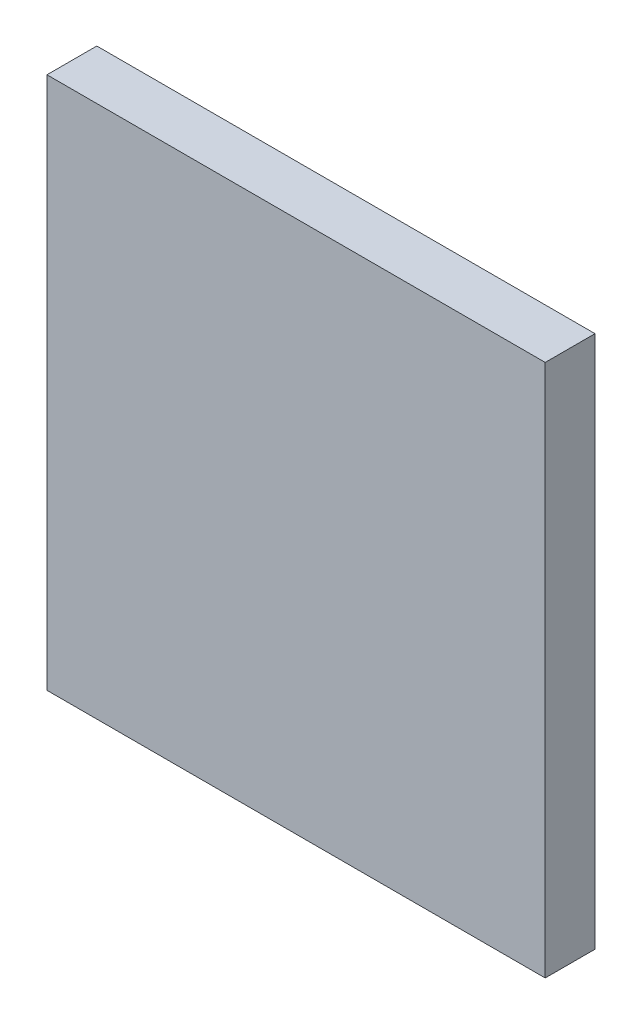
ISO-10303-21;
HEADER;
FILE_DESCRIPTION(('STEP AP214'),'2;1');
FILE_NAME('part.step','',(''),(''),'','','');
FILE_SCHEMA(('AUTOMOTIVE_DESIGN { 1 0 10303 214 1 1 1 1 }'));
ENDSEC;
DATA;
#1=APPLICATION_CONTEXT('core data for automotive mechanical design processes');
#2=APPLICATION_PROTOCOL_DEFINITION('international standard','automotive_design',2000,#1);
#3=PRODUCT_CONTEXT('',#1,'mechanical');
#4=PRODUCT('Part','Part','',(#3));
#5=PRODUCT_RELATED_PRODUCT_CATEGORY('part','',(#4));
#6=PRODUCT_DEFINITION_FORMATION('','',#4);
#7=PRODUCT_DEFINITION_CONTEXT('part definition',#1,'design');
#8=PRODUCT_DEFINITION('design','',#6,#7);
#9=PRODUCT_DEFINITION_SHAPE('','',#8);
#10=(LENGTH_UNIT() NAMED_UNIT(*) SI_UNIT(.MILLI.,.METRE.));
#11=(NAMED_UNIT(*) PLANE_ANGLE_UNIT() SI_UNIT($,.RADIAN.));
#12=(NAMED_UNIT(*) SI_UNIT($,.STERADIAN.) SOLID_ANGLE_UNIT());
#13=UNCERTAINTY_MEASURE_WITH_UNIT(LENGTH_MEASURE(1.E-05),#10,'distance_accuracy_value','');
#14=(GEOMETRIC_REPRESENTATION_CONTEXT(3) GLOBAL_UNCERTAINTY_ASSIGNED_CONTEXT((#13)) GLOBAL_UNIT_ASSIGNED_CONTEXT((#10,
#11,#12)) REPRESENTATION_CONTEXT('',''));
#15=CARTESIAN_POINT('',(0.,0.,0.));
#16=DIRECTION('',(0.,0.,1.));
#17=DIRECTION('',(1.,0.,0.));
#18=AXIS2_PLACEMENT_3D('',#15,#16,#17);
#19=CARTESIAN_POINT('',(0.,0.,20.));
#20=DIRECTION('',(0.,0.,1.));
#21=DIRECTION('',(1.,0.,0.));
#22=AXIS2_PLACEMENT_3D('',#19,#20,#21);
#23=PLANE('',#22);
#24=DIRECTION('',(1.,0.,0.));
#25=VECTOR('',#24,1.);
#26=CARTESIAN_POINT('',(-100.,-107.,20.));
#27=LINE('',#26,#25);
#28=CARTESIAN_POINT('',(-100.,-107.,20.));
#29=VERTEX_POINT('',#28);
#30=CARTESIAN_POINT('',(100.,-107.,20.));
#31=VERTEX_POINT('',#30);
#32=EDGE_CURVE('E70',#29,#31,#27,.T.);
#33=ORIENTED_EDGE('',*,*,#32,.T.);
#34=DIRECTION('',(0.,1.,0.));
#35=VECTOR('',#34,1.);
#36=CARTESIAN_POINT('',(100.,-107.,20.));
#37=LINE('',#36,#35);
#38=CARTESIAN_POINT('',(100.,107.,20.));
#39=VERTEX_POINT('',#38);
#40=EDGE_CURVE('E67',#31,#39,#37,.T.);
#41=ORIENTED_EDGE('',*,*,#40,.T.);
#42=DIRECTION('',(-1.,0.,0.));
#43=VECTOR('',#42,1.);
#44=CARTESIAN_POINT('',(100.,107.,20.));
#45=LINE('',#44,#43);
#46=CARTESIAN_POINT('',(-100.,107.,20.));
#47=VERTEX_POINT('',#46);
#48=EDGE_CURVE('E54',#39,#47,#45,.T.);
#49=ORIENTED_EDGE('',*,*,#48,.T.);
#50=DIRECTION('',(0.,-1.,0.));
#51=VECTOR('',#50,1.);
#52=CARTESIAN_POINT('',(-100.,107.,20.));
#53=LINE('',#52,#51);
#54=EDGE_CURVE('E10',#47,#29,#53,.T.);
#55=ORIENTED_EDGE('',*,*,#54,.T.);
#56=EDGE_LOOP('',(#33,#41,#49,#55));
#57=FACE_BOUND('',#56,.T.);
#58=ADVANCED_FACE('F16',(#57),#23,.T.);
#59=CARTESIAN_POINT('',(0.,0.,0.));
#60=DIRECTION('',(0.,0.,1.));
#61=DIRECTION('',(1.,0.,0.));
#62=AXIS2_PLACEMENT_3D('',#59,#60,#61);
#63=PLANE('',#62);
#64=DIRECTION('',(0.,-1.,0.));
#65=VECTOR('',#64,1.);
#66=CARTESIAN_POINT('',(-100.,107.,0.));
#67=LINE('',#66,#65);
#68=CARTESIAN_POINT('',(-100.,107.,0.));
#69=VERTEX_POINT('',#68);
#70=CARTESIAN_POINT('',(-100.,-107.,0.));
#71=VERTEX_POINT('',#70);
#72=EDGE_CURVE('E20',#69,#71,#67,.T.);
#73=ORIENTED_EDGE('',*,*,#72,.F.);
#74=DIRECTION('',(-1.,0.,0.));
#75=VECTOR('',#74,1.);
#76=CARTESIAN_POINT('',(100.,107.,0.));
#77=LINE('',#76,#75);
#78=CARTESIAN_POINT('',(100.,107.,0.));
#79=VERTEX_POINT('',#78);
#80=EDGE_CURVE('E75',#79,#69,#77,.T.);
#81=ORIENTED_EDGE('',*,*,#80,.F.);
#82=DIRECTION('',(0.,1.,0.));
#83=VECTOR('',#82,1.);
#84=CARTESIAN_POINT('',(100.,-107.,0.));
#85=LINE('',#84,#83);
#86=CARTESIAN_POINT('',(100.,-107.,0.));
#87=VERTEX_POINT('',#86);
#88=EDGE_CURVE('E79',#87,#79,#85,.T.);
#89=ORIENTED_EDGE('',*,*,#88,.F.);
#90=DIRECTION('',(1.,0.,0.));
#91=VECTOR('',#90,1.);
#92=CARTESIAN_POINT('',(-100.,-107.,0.));
#93=LINE('',#92,#91);
#94=EDGE_CURVE('E94',#71,#87,#93,.T.);
#95=ORIENTED_EDGE('',*,*,#94,.F.);
#96=EDGE_LOOP('',(#73,#81,#89,#95));
#97=FACE_BOUND('',#96,.T.);
#98=ADVANCED_FACE('F18',(#97),#63,.F.);
#99=CARTESIAN_POINT('',(-100.,107.,0.));
#100=DIRECTION('',(1.,0.,0.));
#101=DIRECTION('',(0.,1.,0.));
#102=AXIS2_PLACEMENT_3D('',#99,#100,#101);
#103=PLANE('',#102);
#104=ORIENTED_EDGE('',*,*,#72,.T.);
#105=DIRECTION('',(0.,0.,1.));
#106=VECTOR('',#105,1.);
#107=CARTESIAN_POINT('',(-100.,-107.,0.));
#108=LINE('',#107,#106);
#109=EDGE_CURVE('E84',#71,#29,#108,.T.);
#110=ORIENTED_EDGE('',*,*,#109,.T.);
#111=ORIENTED_EDGE('',*,*,#54,.F.);
#112=DIRECTION('',(0.,0.,1.));
#113=VECTOR('',#112,1.);
#114=CARTESIAN_POINT('',(-100.,107.,0.));
#115=LINE('',#114,#113);
#116=EDGE_CURVE('E61',#69,#47,#115,.T.);
#117=ORIENTED_EDGE('',*,*,#116,.F.);
#118=EDGE_LOOP('',(#104,#110,#111,#117));
#119=FACE_BOUND('',#118,.T.);
#120=ADVANCED_FACE('F106',(#119),#103,.F.);
#121=CARTESIAN_POINT('',(100.,107.,0.));
#122=DIRECTION('',(0.,-1.,0.));
#123=DIRECTION('',(0.,0.,-1.));
#124=AXIS2_PLACEMENT_3D('',#121,#122,#123);
#125=PLANE('',#124);
#126=ORIENTED_EDGE('',*,*,#80,.T.);
#127=ORIENTED_EDGE('',*,*,#116,.T.);
#128=ORIENTED_EDGE('',*,*,#48,.F.);
#129=DIRECTION('',(0.,0.,1.));
#130=VECTOR('',#129,1.);
#131=CARTESIAN_POINT('',(100.,107.,0.));
#132=LINE('',#131,#130);
#133=EDGE_CURVE('E59',#79,#39,#132,.T.);
#134=ORIENTED_EDGE('',*,*,#133,.F.);
#135=EDGE_LOOP('',(#126,#127,#128,#134));
#136=FACE_BOUND('',#135,.T.);
#137=ADVANCED_FACE('F57',(#136),#125,.F.);
#138=CARTESIAN_POINT('',(100.,-107.,0.));
#139=DIRECTION('',(-1.,0.,0.));
#140=DIRECTION('',(0.,0.,1.));
#141=AXIS2_PLACEMENT_3D('',#138,#139,#140);
#142=PLANE('',#141);
#143=ORIENTED_EDGE('',*,*,#88,.T.);
#144=ORIENTED_EDGE('',*,*,#133,.T.);
#145=ORIENTED_EDGE('',*,*,#40,.F.);
#146=DIRECTION('',(0.,0.,1.));
#147=VECTOR('',#146,1.);
#148=CARTESIAN_POINT('',(100.,-107.,0.));
#149=LINE('',#148,#147);
#150=EDGE_CURVE('E97',#87,#31,#149,.T.);
#151=ORIENTED_EDGE('',*,*,#150,.F.);
#152=EDGE_LOOP('',(#143,#144,#145,#151));
#153=FACE_BOUND('',#152,.T.);
#154=ADVANCED_FACE('F77',(#153),#142,.F.);
#155=CARTESIAN_POINT('',(-100.,-107.,0.));
#156=DIRECTION('',(0.,1.,0.));
#157=DIRECTION('',(1.,0.,0.));
#158=AXIS2_PLACEMENT_3D('',#155,#156,#157);
#159=PLANE('',#158);
#160=ORIENTED_EDGE('',*,*,#94,.T.);
#161=ORIENTED_EDGE('',*,*,#150,.T.);
#162=ORIENTED_EDGE('',*,*,#32,.F.);
#163=ORIENTED_EDGE('',*,*,#109,.F.);
#164=EDGE_LOOP('',(#160,#161,#162,#163));
#165=FACE_BOUND('',#164,.T.);
#166=ADVANCED_FACE('F110',(#165),#159,.F.);
#167=CLOSED_SHELL('',(#58,#98,#120,#137,#154,#166));
#168=MANIFOLD_SOLID_BREP('B1',#167);
#169=ADVANCED_BREP_SHAPE_REPRESENTATION('',(#18,#168),#14);
#170=SHAPE_DEFINITION_REPRESENTATION(#9,#169);
ENDSEC;
END-ISO-10303-21;
